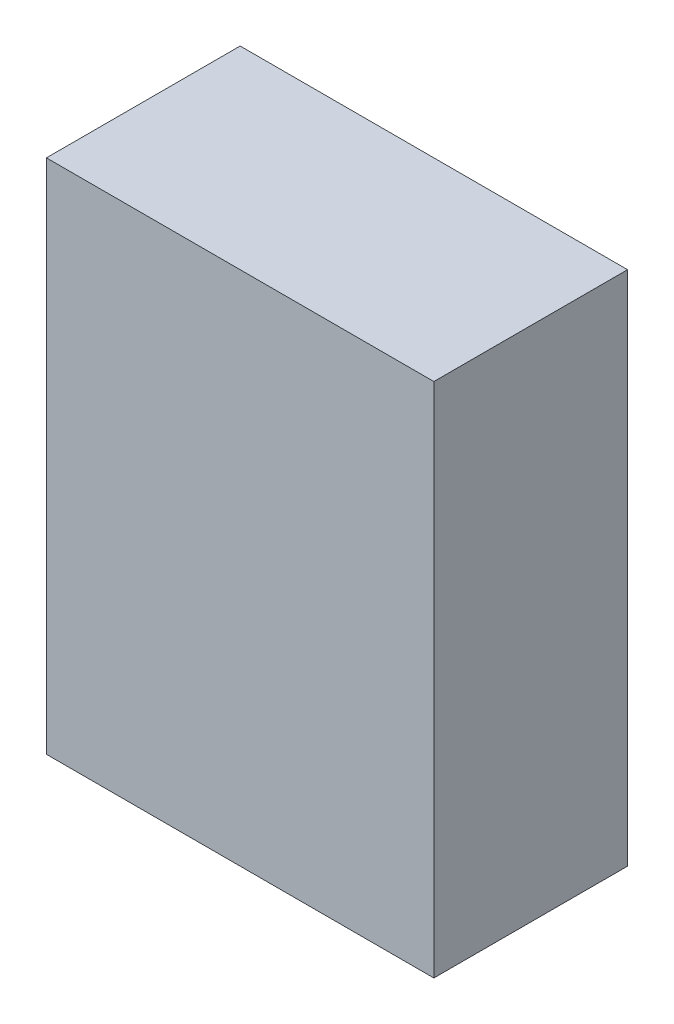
ISO-10303-21;
HEADER;
FILE_DESCRIPTION(('STEP AP214'),'2;1');
FILE_NAME('part.step','',(''),(''),'','','');
FILE_SCHEMA(('AUTOMOTIVE_DESIGN { 1 0 10303 214 1 1 1 1 }'));
ENDSEC;
DATA;
#1=APPLICATION_CONTEXT('core data for automotive mechanical design processes');
#2=APPLICATION_PROTOCOL_DEFINITION('international standard','automotive_design',2000,#1);
#3=PRODUCT_CONTEXT('',#1,'mechanical');
#4=PRODUCT('Part','Part','',(#3));
#5=PRODUCT_RELATED_PRODUCT_CATEGORY('part','',(#4));
#6=PRODUCT_DEFINITION_FORMATION('','',#4);
#7=PRODUCT_DEFINITION_CONTEXT('part definition',#1,'design');
#8=PRODUCT_DEFINITION('design','',#6,#7);
#9=PRODUCT_DEFINITION_SHAPE('','',#8);
#10=(LENGTH_UNIT() NAMED_UNIT(*) SI_UNIT(.MILLI.,.METRE.));
#11=(NAMED_UNIT(*) PLANE_ANGLE_UNIT() SI_UNIT($,.RADIAN.));
#12=(NAMED_UNIT(*) SI_UNIT($,.STERADIAN.) SOLID_ANGLE_UNIT());
#13=UNCERTAINTY_MEASURE_WITH_UNIT(LENGTH_MEASURE(1.E-05),#10,'distance_accuracy_value','');
#14=(GEOMETRIC_REPRESENTATION_CONTEXT(3) GLOBAL_UNCERTAINTY_ASSIGNED_CONTEXT((#13)) GLOBAL_UNIT_ASSIGNED_CONTEXT((#10,
#11,#12)) REPRESENTATION_CONTEXT('',''));
#15=CARTESIAN_POINT('',(0.,0.,0.));
#16=DIRECTION('',(0.,0.,1.));
#17=DIRECTION('',(1.,0.,0.));
#18=AXIS2_PLACEMENT_3D('',#15,#16,#17);
#19=CARTESIAN_POINT('',(0.,0.,38.1));
#20=DIRECTION('',(1.,0.,0.));
#21=DIRECTION('',(0.,1.,0.));
#22=AXIS2_PLACEMENT_3D('',#19,#20,#21);
#23=PLANE('',#22);
#24=DIRECTION('',(0.,-1.,0.));
#25=VECTOR('',#24,1.);
#26=CARTESIAN_POINT('',(0.,0.,0.));
#27=LINE('',#26,#25);
#28=CARTESIAN_POINT('',(0.,101.6,0.));
#29=VERTEX_POINT('',#28);
#30=CARTESIAN_POINT('',(0.,0.,0.));
#31=VERTEX_POINT('',#30);
#32=EDGE_CURVE('E94',#29,#31,#27,.T.);
#33=ORIENTED_EDGE('',*,*,#32,.T.);
#34=DIRECTION('',(0.,0.,-1.));
#35=VECTOR('',#34,1.);
#36=CARTESIAN_POINT('',(0.,0.,38.1));
#37=LINE('',#36,#35);
#38=CARTESIAN_POINT('',(0.,0.,38.1));
#39=VERTEX_POINT('',#38);
#40=EDGE_CURVE('E11',#39,#31,#37,.T.);
#41=ORIENTED_EDGE('',*,*,#40,.F.);
#42=DIRECTION('',(0.,-1.,0.));
#43=VECTOR('',#42,1.);
#44=CARTESIAN_POINT('',(0.,0.,38.1));
#45=LINE('',#44,#43);
#46=CARTESIAN_POINT('',(0.,101.6,38.1));
#47=VERTEX_POINT('',#46);
#48=EDGE_CURVE('E82',#47,#39,#45,.T.);
#49=ORIENTED_EDGE('',*,*,#48,.F.);
#50=DIRECTION('',(0.,0.,-1.));
#51=VECTOR('',#50,1.);
#52=CARTESIAN_POINT('',(0.,101.6,38.1));
#53=LINE('',#52,#51);
#54=EDGE_CURVE('E90',#47,#29,#53,.T.);
#55=ORIENTED_EDGE('',*,*,#54,.T.);
#56=EDGE_LOOP('',(#33,#41,#49,#55));
#57=FACE_BOUND('',#56,.T.);
#58=ADVANCED_FACE('F31',(#57),#23,.F.);
#59=CARTESIAN_POINT('',(0.,0.,38.1));
#60=DIRECTION('',(0.,1.,0.));
#61=DIRECTION('',(0.,0.,1.));
#62=AXIS2_PLACEMENT_3D('',#59,#60,#61);
#63=PLANE('',#62);
#64=DIRECTION('',(1.,0.,0.));
#65=VECTOR('',#64,1.);
#66=CARTESIAN_POINT('',(0.,0.,0.));
#67=LINE('',#66,#65);
#68=CARTESIAN_POINT('',(76.2,0.,0.));
#69=VERTEX_POINT('',#68);
#70=EDGE_CURVE('E86',#31,#69,#67,.T.);
#71=ORIENTED_EDGE('',*,*,#70,.T.);
#72=DIRECTION('',(0.,0.,-1.));
#73=VECTOR('',#72,1.);
#74=CARTESIAN_POINT('',(76.2,0.,38.1));
#75=LINE('',#74,#73);
#76=CARTESIAN_POINT('',(76.2,0.,38.1));
#77=VERTEX_POINT('',#76);
#78=EDGE_CURVE('E39',#77,#69,#75,.T.);
#79=ORIENTED_EDGE('',*,*,#78,.F.);
#80=DIRECTION('',(1.,0.,0.));
#81=VECTOR('',#80,1.);
#82=CARTESIAN_POINT('',(0.,0.,38.1));
#83=LINE('',#82,#81);
#84=EDGE_CURVE('E77',#39,#77,#83,.T.);
#85=ORIENTED_EDGE('',*,*,#84,.F.);
#86=ORIENTED_EDGE('',*,*,#40,.T.);
#87=EDGE_LOOP('',(#71,#79,#85,#86));
#88=FACE_BOUND('',#87,.T.);
#89=ADVANCED_FACE('F85',(#88),#63,.F.);
#90=CARTESIAN_POINT('',(76.2,0.,38.1));
#91=DIRECTION('',(-1.,0.,0.));
#92=DIRECTION('',(0.,-1.,0.));
#93=AXIS2_PLACEMENT_3D('',#90,#91,#92);
#94=PLANE('',#93);
#95=DIRECTION('',(0.,1.,0.));
#96=VECTOR('',#95,1.);
#97=CARTESIAN_POINT('',(76.2,0.,0.));
#98=LINE('',#97,#96);
#99=CARTESIAN_POINT('',(76.2,101.6,0.));
#100=VERTEX_POINT('',#99);
#101=EDGE_CURVE('E64',#69,#100,#98,.T.);
#102=ORIENTED_EDGE('',*,*,#101,.T.);
#103=DIRECTION('',(0.,0.,-1.));
#104=VECTOR('',#103,1.);
#105=CARTESIAN_POINT('',(76.2,101.6,38.1));
#106=LINE('',#105,#104);
#107=CARTESIAN_POINT('',(76.2,101.6,38.1));
#108=VERTEX_POINT('',#107);
#109=EDGE_CURVE('E87',#108,#100,#106,.T.);
#110=ORIENTED_EDGE('',*,*,#109,.F.);
#111=DIRECTION('',(0.,1.,0.));
#112=VECTOR('',#111,1.);
#113=CARTESIAN_POINT('',(76.2,0.,38.1));
#114=LINE('',#113,#112);
#115=EDGE_CURVE('E80',#77,#108,#114,.T.);
#116=ORIENTED_EDGE('',*,*,#115,.F.);
#117=ORIENTED_EDGE('',*,*,#78,.T.);
#118=EDGE_LOOP('',(#102,#110,#116,#117));
#119=FACE_BOUND('',#118,.T.);
#120=ADVANCED_FACE('F88',(#119),#94,.F.);
#121=CARTESIAN_POINT('',(0.,101.6,38.1));
#122=DIRECTION('',(0.,-1.,0.));
#123=DIRECTION('',(0.,0.,-1.));
#124=AXIS2_PLACEMENT_3D('',#121,#122,#123);
#125=PLANE('',#124);
#126=DIRECTION('',(-1.,0.,0.));
#127=VECTOR('',#126,1.);
#128=CARTESIAN_POINT('',(0.,101.6,0.));
#129=LINE('',#128,#127);
#130=EDGE_CURVE('E70',#100,#29,#129,.T.);
#131=ORIENTED_EDGE('',*,*,#130,.T.);
#132=ORIENTED_EDGE('',*,*,#54,.F.);
#133=DIRECTION('',(-1.,0.,0.));
#134=VECTOR('',#133,1.);
#135=CARTESIAN_POINT('',(0.,101.6,38.1));
#136=LINE('',#135,#134);
#137=EDGE_CURVE('E47',#108,#47,#136,.T.);
#138=ORIENTED_EDGE('',*,*,#137,.F.);
#139=ORIENTED_EDGE('',*,*,#109,.T.);
#140=EDGE_LOOP('',(#131,#132,#138,#139));
#141=FACE_BOUND('',#140,.T.);
#142=ADVANCED_FACE('F101',(#141),#125,.F.);
#143=CARTESIAN_POINT('',(0.,101.6,38.1));
#144=DIRECTION('',(0.,0.,-1.));
#145=DIRECTION('',(-1.,0.,0.));
#146=AXIS2_PLACEMENT_3D('',#143,#144,#145);
#147=PLANE('',#146);
#148=ORIENTED_EDGE('',*,*,#48,.T.);
#149=ORIENTED_EDGE('',*,*,#84,.T.);
#150=ORIENTED_EDGE('',*,*,#115,.T.);
#151=ORIENTED_EDGE('',*,*,#137,.T.);
#152=EDGE_LOOP('',(#148,#149,#150,#151));
#153=FACE_BOUND('',#152,.T.);
#154=ADVANCED_FACE('F78',(#153),#147,.F.);
#155=CARTESIAN_POINT('',(0.,101.6,0.));
#156=DIRECTION('',(0.,0.,-1.));
#157=DIRECTION('',(-1.,0.,0.));
#158=AXIS2_PLACEMENT_3D('',#155,#156,#157);
#159=PLANE('',#158);
#160=ORIENTED_EDGE('',*,*,#32,.F.);
#161=ORIENTED_EDGE('',*,*,#130,.F.);
#162=ORIENTED_EDGE('',*,*,#101,.F.);
#163=ORIENTED_EDGE('',*,*,#70,.F.);
#164=EDGE_LOOP('',(#160,#161,#162,#163));
#165=FACE_BOUND('',#164,.T.);
#166=ADVANCED_FACE('F104',(#165),#159,.T.);
#167=CLOSED_SHELL('',(#58,#89,#120,#142,#154,#166));
#168=MANIFOLD_SOLID_BREP('B2',#167);
#169=ADVANCED_BREP_SHAPE_REPRESENTATION('',(#18,#168),#14);
#170=SHAPE_DEFINITION_REPRESENTATION(#9,#169);
ENDSEC;
END-ISO-10303-21;
